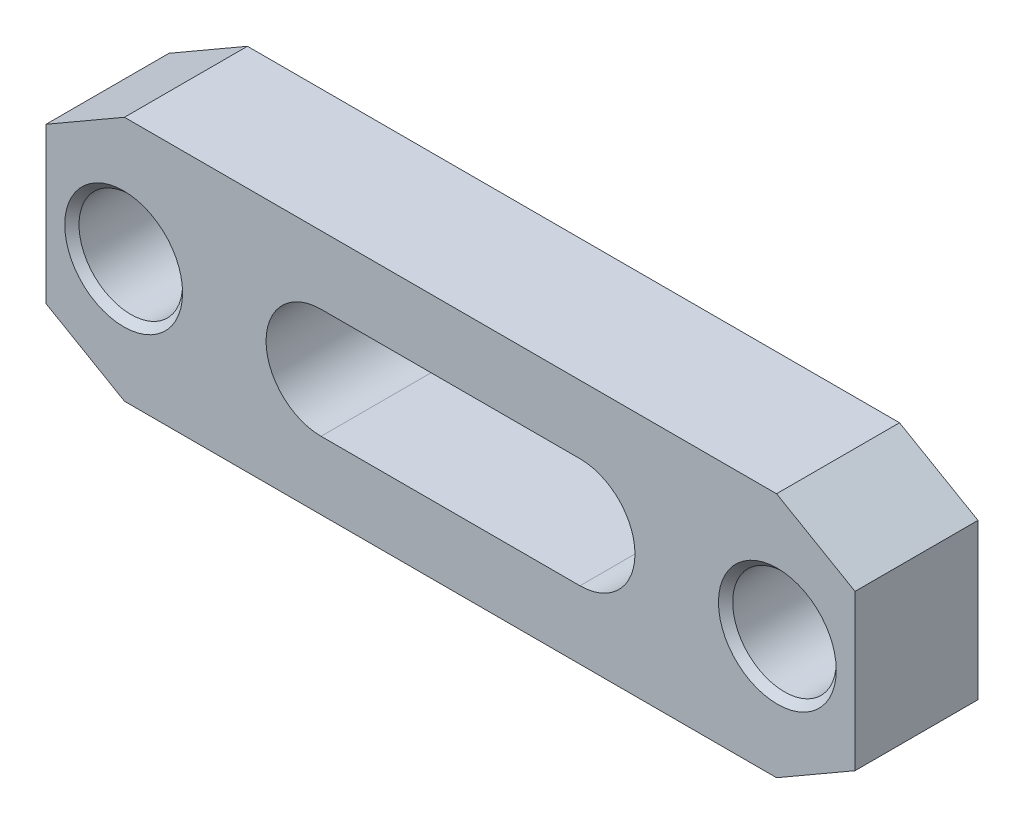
ISO-10303-21;
HEADER;
FILE_DESCRIPTION(('STEP AP214'),'2;1');
FILE_NAME('part.step','',(''),(''),'','','');
FILE_SCHEMA(('AUTOMOTIVE_DESIGN { 1 0 10303 214 1 1 1 1 }'));
ENDSEC;
DATA;
#1=APPLICATION_CONTEXT('core data for automotive mechanical design processes');
#2=APPLICATION_PROTOCOL_DEFINITION('international standard','automotive_design',2000,#1);
#3=PRODUCT_CONTEXT('',#1,'mechanical');
#4=PRODUCT('Part','Part','',(#3));
#5=PRODUCT_RELATED_PRODUCT_CATEGORY('part','',(#4));
#6=PRODUCT_DEFINITION_FORMATION('','',#4);
#7=PRODUCT_DEFINITION_CONTEXT('part definition',#1,'design');
#8=PRODUCT_DEFINITION('design','',#6,#7);
#9=PRODUCT_DEFINITION_SHAPE('','',#8);
#10=(LENGTH_UNIT() NAMED_UNIT(*) SI_UNIT(.MILLI.,.METRE.));
#11=(NAMED_UNIT(*) PLANE_ANGLE_UNIT() SI_UNIT($,.RADIAN.));
#12=(NAMED_UNIT(*) SI_UNIT($,.STERADIAN.) SOLID_ANGLE_UNIT());
#13=UNCERTAINTY_MEASURE_WITH_UNIT(LENGTH_MEASURE(1.E-05),#10,'distance_accuracy_value','');
#14=(GEOMETRIC_REPRESENTATION_CONTEXT(3) GLOBAL_UNCERTAINTY_ASSIGNED_CONTEXT((#13)) GLOBAL_UNIT_ASSIGNED_CONTEXT((#10,
#11,#12)) REPRESENTATION_CONTEXT('',''));
#15=CARTESIAN_POINT('',(0.,0.,0.));
#16=DIRECTION('',(0.,0.,1.));
#17=DIRECTION('',(1.,0.,0.));
#18=AXIS2_PLACEMENT_3D('',#15,#16,#17);
#19=CARTESIAN_POINT('',(62.5,-19.,19.));
#20=DIRECTION('',(0.,0.,1.));
#21=DIRECTION('',(1.,0.,0.));
#22=AXIS2_PLACEMENT_3D('',#19,#20,#21);
#23=PLANE('',#22);
#24=CARTESIAN_POINT('',(50.5,0.,19.));
#25=DIRECTION('',(0.,0.,-1.));
#26=DIRECTION('',(-1.,0.,0.));
#27=AXIS2_PLACEMENT_3D('',#24,#25,#26);
#28=CIRCLE('',#27,9.1);
#29=CARTESIAN_POINT('',(41.4,0.,19.));
#30=VERTEX_POINT('',#29);
#31=EDGE_CURVE('E212',#30,#30,#28,.T.);
#32=ORIENTED_EDGE('',*,*,#31,.T.);
#33=EDGE_LOOP('',(#32));
#34=FACE_BOUND('',#33,.T.);
#35=CARTESIAN_POINT('',(-50.5,0.,19.));
#36=DIRECTION('',(0.,0.,-1.));
#37=DIRECTION('',(-1.,0.,0.));
#38=AXIS2_PLACEMENT_3D('',#35,#36,#37);
#39=CIRCLE('',#38,9.1);
#40=CARTESIAN_POINT('',(-59.6,0.,19.));
#41=VERTEX_POINT('',#40);
#42=EDGE_CURVE('E133',#41,#41,#39,.T.);
#43=ORIENTED_EDGE('',*,*,#42,.T.);
#44=EDGE_LOOP('',(#43));
#45=FACE_BOUND('',#44,.T.);
#46=DIRECTION('',(1.,0.,0.));
#47=VECTOR('',#46,1.);
#48=CARTESIAN_POINT('',(-50.3756443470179,-19.,19.));
#49=LINE('',#48,#47);
#50=CARTESIAN_POINT('',(-50.3756443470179,-19.,19.));
#51=VERTEX_POINT('',#50);
#52=CARTESIAN_POINT('',(50.375644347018,-19.,19.));
#53=VERTEX_POINT('',#52);
#54=EDGE_CURVE('E143',#51,#53,#49,.T.);
#55=ORIENTED_EDGE('',*,*,#54,.T.);
#56=DIRECTION('',(0.866025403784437,0.5,0.));
#57=VECTOR('',#56,1.);
#58=CARTESIAN_POINT('',(50.375644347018,-19.,19.));
#59=LINE('',#58,#57);
#60=CARTESIAN_POINT('',(62.5,-12.,19.));
#61=VERTEX_POINT('',#60);
#62=EDGE_CURVE('E146',#53,#61,#59,.T.);
#63=ORIENTED_EDGE('',*,*,#62,.T.);
#64=DIRECTION('',(0.,1.,0.));
#65=VECTOR('',#64,1.);
#66=CARTESIAN_POINT('',(62.5,-12.,19.));
#67=LINE('',#66,#65);
#68=CARTESIAN_POINT('',(62.5,12.,19.));
#69=VERTEX_POINT('',#68);
#70=EDGE_CURVE('E149',#61,#69,#67,.T.);
#71=ORIENTED_EDGE('',*,*,#70,.T.);
#72=DIRECTION('',(-0.866025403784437,0.5,0.));
#73=VECTOR('',#72,1.);
#74=CARTESIAN_POINT('',(50.375644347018,19.,19.));
#75=LINE('',#74,#73);
#76=CARTESIAN_POINT('',(50.375644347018,19.,19.));
#77=VERTEX_POINT('',#76);
#78=EDGE_CURVE('E151',#69,#77,#75,.T.);
#79=ORIENTED_EDGE('',*,*,#78,.T.);
#80=DIRECTION('',(-1.,0.,0.));
#81=VECTOR('',#80,1.);
#82=CARTESIAN_POINT('',(-50.375644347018,19.,19.));
#83=LINE('',#82,#81);
#84=CARTESIAN_POINT('',(-50.375644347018,19.,19.));
#85=VERTEX_POINT('',#84);
#86=EDGE_CURVE('E153',#77,#85,#83,.T.);
#87=ORIENTED_EDGE('',*,*,#86,.T.);
#88=DIRECTION('',(-0.866025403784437,-0.5,0.));
#89=VECTOR('',#88,1.);
#90=CARTESIAN_POINT('',(-50.375644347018,19.,19.));
#91=LINE('',#90,#89);
#92=CARTESIAN_POINT('',(-62.5,12.,19.));
#93=VERTEX_POINT('',#92);
#94=EDGE_CURVE('E155',#85,#93,#91,.T.);
#95=ORIENTED_EDGE('',*,*,#94,.T.);
#96=DIRECTION('',(0.,-1.,0.));
#97=VECTOR('',#96,1.);
#98=CARTESIAN_POINT('',(-62.5,-12.,19.));
#99=LINE('',#98,#97);
#100=CARTESIAN_POINT('',(-62.5,-12.,19.));
#101=VERTEX_POINT('',#100);
#102=EDGE_CURVE('E157',#93,#101,#99,.T.);
#103=ORIENTED_EDGE('',*,*,#102,.T.);
#104=DIRECTION('',(0.866025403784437,-0.5,0.));
#105=VECTOR('',#104,1.);
#106=CARTESIAN_POINT('',(-50.3756443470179,-19.,19.));
#107=LINE('',#106,#105);
#108=EDGE_CURVE('E159',#101,#51,#107,.T.);
#109=ORIENTED_EDGE('',*,*,#108,.T.);
#110=EDGE_LOOP('',(#55,#63,#71,#79,#87,#95,#103,#109));
#111=FACE_BOUND('',#110,.T.);
#112=DIRECTION('',(-1.,0.,0.));
#113=VECTOR('',#112,1.);
#114=CARTESIAN_POINT('',(20.,8.5,19.));
#115=LINE('',#114,#113);
#116=CARTESIAN_POINT('',(20.,8.5,19.));
#117=VERTEX_POINT('',#116);
#118=CARTESIAN_POINT('',(-20.,8.5,19.));
#119=VERTEX_POINT('',#118);
#120=EDGE_CURVE('E113',#117,#119,#115,.T.);
#121=ORIENTED_EDGE('',*,*,#120,.F.);
#122=CARTESIAN_POINT('',(20.,0.,19.));
#123=DIRECTION('',(0.,0.,1.));
#124=DIRECTION('',(1.,0.,0.));
#125=AXIS2_PLACEMENT_3D('',#122,#123,#124);
#126=CIRCLE('',#125,8.5);
#127=CARTESIAN_POINT('',(20.,-8.5,19.));
#128=VERTEX_POINT('',#127);
#129=EDGE_CURVE('E105',#128,#117,#126,.T.);
#130=ORIENTED_EDGE('',*,*,#129,.F.);
#131=DIRECTION('',(1.,0.,0.));
#132=VECTOR('',#131,1.);
#133=CARTESIAN_POINT('',(20.,-8.5,19.));
#134=LINE('',#133,#132);
#135=CARTESIAN_POINT('',(-20.,-8.5,19.));
#136=VERTEX_POINT('',#135);
#137=EDGE_CURVE('E127',#136,#128,#134,.T.);
#138=ORIENTED_EDGE('',*,*,#137,.F.);
#139=CARTESIAN_POINT('',(-20.,0.,19.));
#140=DIRECTION('',(0.,0.,1.));
#141=DIRECTION('',(1.,0.,0.));
#142=AXIS2_PLACEMENT_3D('',#139,#140,#141);
#143=CIRCLE('',#142,8.5);
#144=EDGE_CURVE('E125',#119,#136,#143,.T.);
#145=ORIENTED_EDGE('',*,*,#144,.F.);
#146=EDGE_LOOP('',(#121,#130,#138,#145));
#147=FACE_BOUND('',#146,.T.);
#148=ADVANCED_FACE('F14',(#34,#45,#111,#147),#23,.T.);
#149=CARTESIAN_POINT('',(62.5,-19.,0.));
#150=DIRECTION('',(0.,0.,1.));
#151=DIRECTION('',(1.,0.,0.));
#152=AXIS2_PLACEMENT_3D('',#149,#150,#151);
#153=PLANE('',#152);
#154=CARTESIAN_POINT('',(50.5,0.,0.));
#155=DIRECTION('',(0.,0.,-1.));
#156=DIRECTION('',(-1.,0.,0.));
#157=AXIS2_PLACEMENT_3D('',#154,#155,#156);
#158=CIRCLE('',#157,9.1);
#159=CARTESIAN_POINT('',(41.4,0.,0.));
#160=VERTEX_POINT('',#159);
#161=EDGE_CURVE('E202',#160,#160,#158,.T.);
#162=ORIENTED_EDGE('',*,*,#161,.F.);
#163=EDGE_LOOP('',(#162));
#164=FACE_BOUND('',#163,.T.);
#165=CARTESIAN_POINT('',(-50.5,0.,0.));
#166=DIRECTION('',(0.,0.,-1.));
#167=DIRECTION('',(-1.,0.,0.));
#168=AXIS2_PLACEMENT_3D('',#165,#166,#167);
#169=CIRCLE('',#168,9.1);
#170=CARTESIAN_POINT('',(-59.6,0.,0.));
#171=VERTEX_POINT('',#170);
#172=EDGE_CURVE('E215',#171,#171,#169,.T.);
#173=ORIENTED_EDGE('',*,*,#172,.F.);
#174=EDGE_LOOP('',(#173));
#175=FACE_BOUND('',#174,.T.);
#176=DIRECTION('',(1.,0.,0.));
#177=VECTOR('',#176,1.);
#178=CARTESIAN_POINT('',(-50.3756443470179,-19.,0.));
#179=LINE('',#178,#177);
#180=CARTESIAN_POINT('',(-50.3756443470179,-19.,0.));
#181=VERTEX_POINT('',#180);
#182=CARTESIAN_POINT('',(50.375644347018,-19.,0.));
#183=VERTEX_POINT('',#182);
#184=EDGE_CURVE('E121',#181,#183,#179,.T.);
#185=ORIENTED_EDGE('',*,*,#184,.F.);
#186=DIRECTION('',(0.866025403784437,-0.5,0.));
#187=VECTOR('',#186,1.);
#188=CARTESIAN_POINT('',(-50.3756443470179,-19.,0.));
#189=LINE('',#188,#187);
#190=CARTESIAN_POINT('',(-62.5,-12.,0.));
#191=VERTEX_POINT('',#190);
#192=EDGE_CURVE('E147',#191,#181,#189,.T.);
#193=ORIENTED_EDGE('',*,*,#192,.F.);
#194=DIRECTION('',(0.,-1.,0.));
#195=VECTOR('',#194,1.);
#196=CARTESIAN_POINT('',(-62.5,-12.,0.));
#197=LINE('',#196,#195);
#198=CARTESIAN_POINT('',(-62.5,12.,0.));
#199=VERTEX_POINT('',#198);
#200=EDGE_CURVE('E174',#199,#191,#197,.T.);
#201=ORIENTED_EDGE('',*,*,#200,.F.);
#202=DIRECTION('',(-0.866025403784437,-0.5,0.));
#203=VECTOR('',#202,1.);
#204=CARTESIAN_POINT('',(-50.375644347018,19.,0.));
#205=LINE('',#204,#203);
#206=CARTESIAN_POINT('',(-50.375644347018,19.,0.));
#207=VERTEX_POINT('',#206);
#208=EDGE_CURVE('E172',#207,#199,#205,.T.);
#209=ORIENTED_EDGE('',*,*,#208,.F.);
#210=DIRECTION('',(-1.,0.,0.));
#211=VECTOR('',#210,1.);
#212=CARTESIAN_POINT('',(-50.375644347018,19.,0.));
#213=LINE('',#212,#211);
#214=CARTESIAN_POINT('',(50.375644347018,19.,0.));
#215=VERTEX_POINT('',#214);
#216=EDGE_CURVE('E170',#215,#207,#213,.T.);
#217=ORIENTED_EDGE('',*,*,#216,.F.);
#218=DIRECTION('',(-0.866025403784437,0.5,0.));
#219=VECTOR('',#218,1.);
#220=CARTESIAN_POINT('',(50.375644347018,19.,0.));
#221=LINE('',#220,#219);
#222=CARTESIAN_POINT('',(62.5,12.,0.));
#223=VERTEX_POINT('',#222);
#224=EDGE_CURVE('E168',#223,#215,#221,.T.);
#225=ORIENTED_EDGE('',*,*,#224,.F.);
#226=DIRECTION('',(0.,1.,0.));
#227=VECTOR('',#226,1.);
#228=CARTESIAN_POINT('',(62.5,-12.,0.));
#229=LINE('',#228,#227);
#230=CARTESIAN_POINT('',(62.5,-12.,0.));
#231=VERTEX_POINT('',#230);
#232=EDGE_CURVE('E166',#231,#223,#229,.T.);
#233=ORIENTED_EDGE('',*,*,#232,.F.);
#234=DIRECTION('',(0.866025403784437,0.5,0.));
#235=VECTOR('',#234,1.);
#236=CARTESIAN_POINT('',(50.375644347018,-19.,0.));
#237=LINE('',#236,#235);
#238=EDGE_CURVE('E164',#183,#231,#237,.T.);
#239=ORIENTED_EDGE('',*,*,#238,.F.);
#240=EDGE_LOOP('',(#185,#193,#201,#209,#217,#225,#233,#239));
#241=FACE_BOUND('',#240,.T.);
#242=CARTESIAN_POINT('',(20.,0.,0.));
#243=DIRECTION('',(0.,0.,1.));
#244=DIRECTION('',(1.,0.,0.));
#245=AXIS2_PLACEMENT_3D('',#242,#243,#244);
#246=CIRCLE('',#245,8.5);
#247=CARTESIAN_POINT('',(20.,-8.5,0.));
#248=VERTEX_POINT('',#247);
#249=CARTESIAN_POINT('',(20.,8.5,0.));
#250=VERTEX_POINT('',#249);
#251=EDGE_CURVE('E39',#248,#250,#246,.T.);
#252=ORIENTED_EDGE('',*,*,#251,.T.);
#253=DIRECTION('',(-1.,0.,0.));
#254=VECTOR('',#253,1.);
#255=CARTESIAN_POINT('',(20.,8.5,0.));
#256=LINE('',#255,#254);
#257=CARTESIAN_POINT('',(-20.,8.5,0.));
#258=VERTEX_POINT('',#257);
#259=EDGE_CURVE('E120',#250,#258,#256,.T.);
#260=ORIENTED_EDGE('',*,*,#259,.T.);
#261=CARTESIAN_POINT('',(-20.,0.,0.));
#262=DIRECTION('',(0.,0.,1.));
#263=DIRECTION('',(1.,0.,0.));
#264=AXIS2_PLACEMENT_3D('',#261,#262,#263);
#265=CIRCLE('',#264,8.5);
#266=CARTESIAN_POINT('',(-20.,-8.5,0.));
#267=VERTEX_POINT('',#266);
#268=EDGE_CURVE('E135',#258,#267,#265,.T.);
#269=ORIENTED_EDGE('',*,*,#268,.T.);
#270=DIRECTION('',(1.,0.,0.));
#271=VECTOR('',#270,1.);
#272=CARTESIAN_POINT('',(20.,-8.5,0.));
#273=LINE('',#272,#271);
#274=EDGE_CURVE('E114',#267,#248,#273,.T.);
#275=ORIENTED_EDGE('',*,*,#274,.T.);
#276=EDGE_LOOP('',(#252,#260,#269,#275));
#277=FACE_BOUND('',#276,.T.);
#278=ADVANCED_FACE('F238',(#164,#175,#241,#277),#153,.F.);
#279=CARTESIAN_POINT('',(-50.3756443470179,-19.,19.));
#280=DIRECTION('',(0.,1.,0.));
#281=DIRECTION('',(-1.,0.,0.));
#282=AXIS2_PLACEMENT_3D('',#279,#280,#281);
#283=PLANE('',#282);
#284=ORIENTED_EDGE('',*,*,#184,.T.);
#285=DIRECTION('',(0.,0.,-1.));
#286=VECTOR('',#285,1.);
#287=CARTESIAN_POINT('',(50.375644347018,-19.,19.));
#288=LINE('',#287,#286);
#289=EDGE_CURVE('E9',#53,#183,#288,.T.);
#290=ORIENTED_EDGE('',*,*,#289,.F.);
#291=ORIENTED_EDGE('',*,*,#54,.F.);
#292=DIRECTION('',(0.,0.,-1.));
#293=VECTOR('',#292,1.);
#294=CARTESIAN_POINT('',(-50.3756443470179,-19.,19.));
#295=LINE('',#294,#293);
#296=EDGE_CURVE('E161',#51,#181,#295,.T.);
#297=ORIENTED_EDGE('',*,*,#296,.T.);
#298=EDGE_LOOP('',(#284,#290,#291,#297));
#299=FACE_BOUND('',#298,.T.);
#300=ADVANCED_FACE('F16',(#299),#283,.F.);
#301=CARTESIAN_POINT('',(50.375644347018,-19.,19.));
#302=DIRECTION('',(-0.5,0.866025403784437,0.));
#303=DIRECTION('',(-0.866025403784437,-0.5,0.));
#304=AXIS2_PLACEMENT_3D('',#301,#302,#303);
#305=PLANE('',#304);
#306=ORIENTED_EDGE('',*,*,#238,.T.);
#307=DIRECTION('',(0.,0.,-1.));
#308=VECTOR('',#307,1.);
#309=CARTESIAN_POINT('',(62.5,-12.,19.));
#310=LINE('',#309,#308);
#311=EDGE_CURVE('E23',#61,#231,#310,.T.);
#312=ORIENTED_EDGE('',*,*,#311,.F.);
#313=ORIENTED_EDGE('',*,*,#62,.F.);
#314=ORIENTED_EDGE('',*,*,#289,.T.);
#315=EDGE_LOOP('',(#306,#312,#313,#314));
#316=FACE_BOUND('',#315,.T.);
#317=ADVANCED_FACE('F271',(#316),#305,.F.);
#318=CARTESIAN_POINT('',(62.5,-12.,19.));
#319=DIRECTION('',(-1.,0.,0.));
#320=DIRECTION('',(0.,0.,1.));
#321=AXIS2_PLACEMENT_3D('',#318,#319,#320);
#322=PLANE('',#321);
#323=ORIENTED_EDGE('',*,*,#232,.T.);
#324=DIRECTION('',(0.,0.,-1.));
#325=VECTOR('',#324,1.);
#326=CARTESIAN_POINT('',(62.5,12.,19.));
#327=LINE('',#326,#325);
#328=EDGE_CURVE('E191',#69,#223,#327,.T.);
#329=ORIENTED_EDGE('',*,*,#328,.F.);
#330=ORIENTED_EDGE('',*,*,#70,.F.);
#331=ORIENTED_EDGE('',*,*,#311,.T.);
#332=EDGE_LOOP('',(#323,#329,#330,#331));
#333=FACE_BOUND('',#332,.T.);
#334=ADVANCED_FACE('F268',(#333),#322,.F.);
#335=CARTESIAN_POINT('',(50.375644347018,19.,19.));
#336=DIRECTION('',(-0.5,-0.866025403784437,0.));
#337=DIRECTION('',(0.866025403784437,-0.5,0.));
#338=AXIS2_PLACEMENT_3D('',#335,#336,#337);
#339=PLANE('',#338);
#340=ORIENTED_EDGE('',*,*,#224,.T.);
#341=DIRECTION('',(0.,0.,-1.));
#342=VECTOR('',#341,1.);
#343=CARTESIAN_POINT('',(50.375644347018,19.,19.));
#344=LINE('',#343,#342);
#345=EDGE_CURVE('E188',#77,#215,#344,.T.);
#346=ORIENTED_EDGE('',*,*,#345,.F.);
#347=ORIENTED_EDGE('',*,*,#78,.F.);
#348=ORIENTED_EDGE('',*,*,#328,.T.);
#349=EDGE_LOOP('',(#340,#346,#347,#348));
#350=FACE_BOUND('',#349,.T.);
#351=ADVANCED_FACE('F264',(#350),#339,.F.);
#352=CARTESIAN_POINT('',(-50.375644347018,19.,19.));
#353=DIRECTION('',(0.,-1.,0.));
#354=DIRECTION('',(0.,0.,-1.));
#355=AXIS2_PLACEMENT_3D('',#352,#353,#354);
#356=PLANE('',#355);
#357=ORIENTED_EDGE('',*,*,#216,.T.);
#358=DIRECTION('',(0.,0.,-1.));
#359=VECTOR('',#358,1.);
#360=CARTESIAN_POINT('',(-50.375644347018,19.,19.));
#361=LINE('',#360,#359);
#362=EDGE_CURVE('E185',#85,#207,#361,.T.);
#363=ORIENTED_EDGE('',*,*,#362,.F.);
#364=ORIENTED_EDGE('',*,*,#86,.F.);
#365=ORIENTED_EDGE('',*,*,#345,.T.);
#366=EDGE_LOOP('',(#357,#363,#364,#365));
#367=FACE_BOUND('',#366,.T.);
#368=ADVANCED_FACE('F260',(#367),#356,.F.);
#369=CARTESIAN_POINT('',(-50.375644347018,19.,19.));
#370=DIRECTION('',(0.5,-0.866025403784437,0.));
#371=DIRECTION('',(0.866025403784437,0.5,0.));
#372=AXIS2_PLACEMENT_3D('',#369,#370,#371);
#373=PLANE('',#372);
#374=ORIENTED_EDGE('',*,*,#208,.T.);
#375=DIRECTION('',(0.,0.,-1.));
#376=VECTOR('',#375,1.);
#377=CARTESIAN_POINT('',(-62.5,12.,19.));
#378=LINE('',#377,#376);
#379=EDGE_CURVE('E182',#93,#199,#378,.T.);
#380=ORIENTED_EDGE('',*,*,#379,.F.);
#381=ORIENTED_EDGE('',*,*,#94,.F.);
#382=ORIENTED_EDGE('',*,*,#362,.T.);
#383=EDGE_LOOP('',(#374,#380,#381,#382));
#384=FACE_BOUND('',#383,.T.);
#385=ADVANCED_FACE('F256',(#384),#373,.F.);
#386=CARTESIAN_POINT('',(-62.5,-12.,19.));
#387=DIRECTION('',(1.,0.,0.));
#388=DIRECTION('',(0.,0.,-1.));
#389=AXIS2_PLACEMENT_3D('',#386,#387,#388);
#390=PLANE('',#389);
#391=ORIENTED_EDGE('',*,*,#200,.T.);
#392=DIRECTION('',(0.,0.,-1.));
#393=VECTOR('',#392,1.);
#394=CARTESIAN_POINT('',(-62.5,-12.,19.));
#395=LINE('',#394,#393);
#396=EDGE_CURVE('E179',#101,#191,#395,.T.);
#397=ORIENTED_EDGE('',*,*,#396,.F.);
#398=ORIENTED_EDGE('',*,*,#102,.F.);
#399=ORIENTED_EDGE('',*,*,#379,.T.);
#400=EDGE_LOOP('',(#391,#397,#398,#399));
#401=FACE_BOUND('',#400,.T.);
#402=ADVANCED_FACE('F252',(#401),#390,.F.);
#403=CARTESIAN_POINT('',(-50.3756443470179,-19.,19.));
#404=DIRECTION('',(0.5,0.866025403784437,0.));
#405=DIRECTION('',(-0.866025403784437,0.5,0.));
#406=AXIS2_PLACEMENT_3D('',#403,#404,#405);
#407=PLANE('',#406);
#408=ORIENTED_EDGE('',*,*,#192,.T.);
#409=ORIENTED_EDGE('',*,*,#296,.F.);
#410=ORIENTED_EDGE('',*,*,#108,.F.);
#411=ORIENTED_EDGE('',*,*,#396,.T.);
#412=EDGE_LOOP('',(#408,#409,#410,#411));
#413=FACE_BOUND('',#412,.T.);
#414=ADVANCED_FACE('F249',(#413),#407,.F.);
#415=CARTESIAN_POINT('',(20.,0.,19.));
#416=DIRECTION('',(0.,0.,-1.));
#417=DIRECTION('',(-1.,0.,0.));
#418=AXIS2_PLACEMENT_3D('',#415,#416,#417);
#419=CYLINDRICAL_SURFACE('',#418,8.5);
#420=ORIENTED_EDGE('',*,*,#251,.F.);
#421=DIRECTION('',(0.,0.,-1.));
#422=VECTOR('',#421,1.);
#423=CARTESIAN_POINT('',(20.,-8.5,19.));
#424=LINE('',#423,#422);
#425=EDGE_CURVE('E109',#128,#248,#424,.T.);
#426=ORIENTED_EDGE('',*,*,#425,.F.);
#427=ORIENTED_EDGE('',*,*,#129,.T.);
#428=DIRECTION('',(0.,0.,-1.));
#429=VECTOR('',#428,1.);
#430=CARTESIAN_POINT('',(20.,8.5,19.));
#431=LINE('',#430,#429);
#432=EDGE_CURVE('E108',#117,#250,#431,.T.);
#433=ORIENTED_EDGE('',*,*,#432,.T.);
#434=EDGE_LOOP('',(#420,#426,#427,#433));
#435=FACE_BOUND('',#434,.T.);
#436=ADVANCED_FACE('F107',(#435),#419,.F.);
#437=CARTESIAN_POINT('',(20.,8.5,19.));
#438=DIRECTION('',(0.,-1.,0.));
#439=DIRECTION('',(1.,0.,0.));
#440=AXIS2_PLACEMENT_3D('',#437,#438,#439);
#441=PLANE('',#440);
#442=ORIENTED_EDGE('',*,*,#259,.F.);
#443=ORIENTED_EDGE('',*,*,#432,.F.);
#444=ORIENTED_EDGE('',*,*,#120,.T.);
#445=DIRECTION('',(0.,0.,-1.));
#446=VECTOR('',#445,1.);
#447=CARTESIAN_POINT('',(-20.,8.5,19.));
#448=LINE('',#447,#446);
#449=EDGE_CURVE('E122',#119,#258,#448,.T.);
#450=ORIENTED_EDGE('',*,*,#449,.T.);
#451=EDGE_LOOP('',(#442,#443,#444,#450));
#452=FACE_BOUND('',#451,.T.);
#453=ADVANCED_FACE('F117',(#452),#441,.T.);
#454=CARTESIAN_POINT('',(-20.,0.,19.));
#455=DIRECTION('',(0.,0.,-1.));
#456=DIRECTION('',(-1.,0.,0.));
#457=AXIS2_PLACEMENT_3D('',#454,#455,#456);
#458=CYLINDRICAL_SURFACE('',#457,8.5);
#459=ORIENTED_EDGE('',*,*,#268,.F.);
#460=ORIENTED_EDGE('',*,*,#449,.F.);
#461=ORIENTED_EDGE('',*,*,#144,.T.);
#462=DIRECTION('',(0.,0.,-1.));
#463=VECTOR('',#462,1.);
#464=CARTESIAN_POINT('',(-20.,-8.5,19.));
#465=LINE('',#464,#463);
#466=EDGE_CURVE('E31',#136,#267,#465,.T.);
#467=ORIENTED_EDGE('',*,*,#466,.T.);
#468=EDGE_LOOP('',(#459,#460,#461,#467));
#469=FACE_BOUND('',#468,.T.);
#470=ADVANCED_FACE('F235',(#469),#458,.F.);
#471=CARTESIAN_POINT('',(20.,-8.5,19.));
#472=DIRECTION('',(0.,1.,0.));
#473=DIRECTION('',(-1.,0.,0.));
#474=AXIS2_PLACEMENT_3D('',#471,#472,#473);
#475=PLANE('',#474);
#476=ORIENTED_EDGE('',*,*,#274,.F.);
#477=ORIENTED_EDGE('',*,*,#466,.F.);
#478=ORIENTED_EDGE('',*,*,#137,.T.);
#479=ORIENTED_EDGE('',*,*,#425,.T.);
#480=EDGE_LOOP('',(#476,#477,#478,#479));
#481=FACE_BOUND('',#480,.T.);
#482=ADVANCED_FACE('F225',(#481),#475,.T.);
#483=CARTESIAN_POINT('',(-50.5,0.,17.));
#484=DIRECTION('',(0.,0.,1.));
#485=DIRECTION('',(1.,0.,0.));
#486=AXIS2_PLACEMENT_3D('',#483,#484,#485);
#487=CONICAL_SURFACE('',#486,7.1,0.78539816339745);
#488=CARTESIAN_POINT('',(-50.5,0.,17.9));
#489=DIRECTION('',(0.,0.,1.));
#490=DIRECTION('',(1.,0.,0.));
#491=AXIS2_PLACEMENT_3D('',#488,#489,#490);
#492=CIRCLE('',#491,8.);
#493=CARTESIAN_POINT('',(-42.5,0.,17.9));
#494=VERTEX_POINT('',#493);
#495=EDGE_CURVE('E197',#494,#494,#492,.F.);
#496=ORIENTED_EDGE('',*,*,#495,.T.);
#497=EDGE_LOOP('',(#496));
#498=FACE_BOUND('',#497,.T.);
#499=ORIENTED_EDGE('',*,*,#42,.F.);
#500=EDGE_LOOP('',(#499));
#501=FACE_BOUND('',#500,.T.);
#502=ADVANCED_FACE('F222',(#498,#501),#487,.F.);
#503=CARTESIAN_POINT('',(-50.5,0.,0.));
#504=DIRECTION('',(0.,0.,-1.));
#505=DIRECTION('',(-1.,0.,0.));
#506=AXIS2_PLACEMENT_3D('',#503,#504,#505);
#507=CONICAL_SURFACE('',#506,9.1,0.78539816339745);
#508=CARTESIAN_POINT('',(-50.5,0.,1.1));
#509=DIRECTION('',(0.,0.,-1.));
#510=DIRECTION('',(-1.,0.,0.));
#511=AXIS2_PLACEMENT_3D('',#508,#509,#510);
#512=CIRCLE('',#511,8.);
#513=CARTESIAN_POINT('',(-58.5,0.,1.1));
#514=VERTEX_POINT('',#513);
#515=EDGE_CURVE('E195',#514,#514,#512,.F.);
#516=ORIENTED_EDGE('',*,*,#515,.T.);
#517=EDGE_LOOP('',(#516));
#518=FACE_BOUND('',#517,.T.);
#519=ORIENTED_EDGE('',*,*,#172,.T.);
#520=EDGE_LOOP('',(#519));
#521=FACE_BOUND('',#520,.T.);
#522=ADVANCED_FACE('F224',(#518,#521),#507,.F.);
#523=CARTESIAN_POINT('',(50.5,0.,17.));
#524=DIRECTION('',(0.,0.,1.));
#525=DIRECTION('',(1.,0.,0.));
#526=AXIS2_PLACEMENT_3D('',#523,#524,#525);
#527=CONICAL_SURFACE('',#526,7.1,0.78539816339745);
#528=CARTESIAN_POINT('',(50.5,0.,17.9));
#529=DIRECTION('',(0.,0.,1.));
#530=DIRECTION('',(1.,0.,0.));
#531=AXIS2_PLACEMENT_3D('',#528,#529,#530);
#532=CIRCLE('',#531,8.);
#533=CARTESIAN_POINT('',(58.5,0.,17.9));
#534=VERTEX_POINT('',#533);
#535=EDGE_CURVE('E198',#534,#534,#532,.F.);
#536=ORIENTED_EDGE('',*,*,#535,.T.);
#537=EDGE_LOOP('',(#536));
#538=FACE_BOUND('',#537,.T.);
#539=ORIENTED_EDGE('',*,*,#31,.F.);
#540=EDGE_LOOP('',(#539));
#541=FACE_BOUND('',#540,.T.);
#542=ADVANCED_FACE('F233',(#538,#541),#527,.F.);
#543=CARTESIAN_POINT('',(50.5,0.,0.));
#544=DIRECTION('',(0.,0.,-1.));
#545=DIRECTION('',(-1.,0.,0.));
#546=AXIS2_PLACEMENT_3D('',#543,#544,#545);
#547=CONICAL_SURFACE('',#546,9.1,0.78539816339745);
#548=CARTESIAN_POINT('',(50.5,0.,1.1));
#549=DIRECTION('',(0.,0.,-1.));
#550=DIRECTION('',(-1.,0.,0.));
#551=AXIS2_PLACEMENT_3D('',#548,#549,#550);
#552=CIRCLE('',#551,8.);
#553=CARTESIAN_POINT('',(42.5,0.,1.1));
#554=VERTEX_POINT('',#553);
#555=EDGE_CURVE('E18',#554,#554,#552,.F.);
#556=ORIENTED_EDGE('',*,*,#555,.T.);
#557=EDGE_LOOP('',(#556));
#558=FACE_BOUND('',#557,.T.);
#559=ORIENTED_EDGE('',*,*,#161,.T.);
#560=EDGE_LOOP('',(#559));
#561=FACE_BOUND('',#560,.T.);
#562=ADVANCED_FACE('F398',(#558,#561),#547,.F.);
#563=CARTESIAN_POINT('',(-50.5,0.,0.));
#564=DIRECTION('',(0.,0.,1.));
#565=DIRECTION('',(1.,0.,0.));
#566=AXIS2_PLACEMENT_3D('',#563,#564,#565);
#567=CYLINDRICAL_SURFACE('',#566,8.);
#568=ORIENTED_EDGE('',*,*,#515,.F.);
#569=EDGE_LOOP('',(#568));
#570=FACE_BOUND('',#569,.T.);
#571=ORIENTED_EDGE('',*,*,#495,.F.);
#572=EDGE_LOOP('',(#571));
#573=FACE_BOUND('',#572,.T.);
#574=ADVANCED_FACE('F407',(#570,#573),#567,.F.);
#575=CARTESIAN_POINT('',(50.5,0.,0.));
#576=DIRECTION('',(0.,0.,1.));
#577=DIRECTION('',(1.,0.,0.));
#578=AXIS2_PLACEMENT_3D('',#575,#576,#577);
#579=CYLINDRICAL_SURFACE('',#578,8.);
#580=ORIENTED_EDGE('',*,*,#555,.F.);
#581=EDGE_LOOP('',(#580));
#582=FACE_BOUND('',#581,.T.);
#583=ORIENTED_EDGE('',*,*,#535,.F.);
#584=EDGE_LOOP('',(#583));
#585=FACE_BOUND('',#584,.T.);
#586=ADVANCED_FACE('F417',(#582,#585),#579,.F.);
#587=CLOSED_SHELL('',(#148,#278,#300,#317,#334,#351,#368,#385,#402,#414,#436,#453,#470,#482,
#502,#522,#542,#562,#574,#586));
#588=MANIFOLD_SOLID_BREP('B1',#587);
#589=ADVANCED_BREP_SHAPE_REPRESENTATION('',(#18,#588),#14);
#590=SHAPE_DEFINITION_REPRESENTATION(#9,#589);
ENDSEC;
END-ISO-10303-21;
